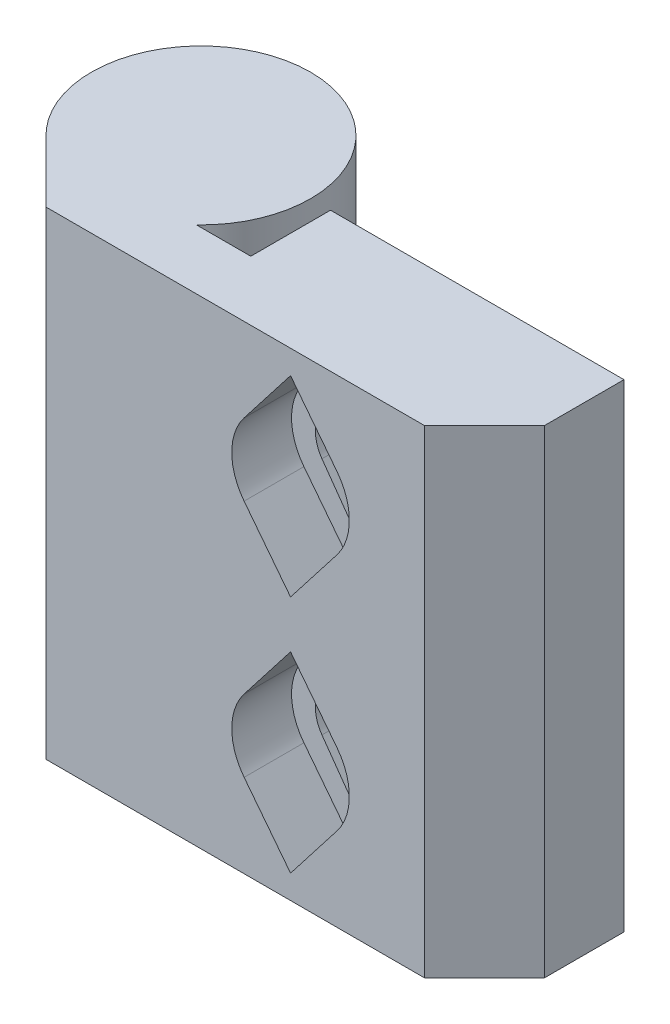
ISO-10303-21;
HEADER;
FILE_DESCRIPTION(('STEP AP214'),'2;1');
FILE_NAME('part.step','',(''),(''),'','','');
FILE_SCHEMA(('AUTOMOTIVE_DESIGN { 1 0 10303 214 1 1 1 1 }'));
ENDSEC;
DATA;
#1=APPLICATION_CONTEXT('core data for automotive mechanical design processes');
#2=APPLICATION_PROTOCOL_DEFINITION('international standard','automotive_design',2000,#1);
#3=PRODUCT_CONTEXT('',#1,'mechanical');
#4=PRODUCT('Part','Part','',(#3));
#5=PRODUCT_RELATED_PRODUCT_CATEGORY('part','',(#4));
#6=PRODUCT_DEFINITION_FORMATION('','',#4);
#7=PRODUCT_DEFINITION_CONTEXT('part definition',#1,'design');
#8=PRODUCT_DEFINITION('design','',#6,#7);
#9=PRODUCT_DEFINITION_SHAPE('','',#8);
#10=(LENGTH_UNIT() NAMED_UNIT(*) SI_UNIT(.MILLI.,.METRE.));
#11=(NAMED_UNIT(*) PLANE_ANGLE_UNIT() SI_UNIT($,.RADIAN.));
#12=(NAMED_UNIT(*) SI_UNIT($,.STERADIAN.) SOLID_ANGLE_UNIT());
#13=UNCERTAINTY_MEASURE_WITH_UNIT(LENGTH_MEASURE(1.E-05),#10,'distance_accuracy_value','');
#14=(GEOMETRIC_REPRESENTATION_CONTEXT(3) GLOBAL_UNCERTAINTY_ASSIGNED_CONTEXT((#13)) GLOBAL_UNIT_ASSIGNED_CONTEXT((#10,
#11,#12)) REPRESENTATION_CONTEXT('',''));
#15=CARTESIAN_POINT('',(0.,0.,0.));
#16=DIRECTION('',(0.,0.,1.));
#17=DIRECTION('',(1.,0.,0.));
#18=AXIS2_PLACEMENT_3D('',#15,#16,#17);
#19=CARTESIAN_POINT('',(11.4950827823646,6.,4.));
#20=DIRECTION('',(0.,0.,-1.));
#21=DIRECTION('',(-1.,0.,0.));
#22=AXIS2_PLACEMENT_3D('',#19,#20,#21);
#23=PLANE('',#22);
#24=DIRECTION('',(-0.613374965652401,-0.789791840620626,0.));
#25=VECTOR('',#24,1.);
#26=CARTESIAN_POINT('',(9.16519685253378,7.80945614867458,4.));
#27=LINE('',#26,#25);
#28=CARTESIAN_POINT('',(11.4950827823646,10.8094561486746,4.));
#29=VERTEX_POINT('',#28);
#30=CARTESIAN_POINT('',(9.16519685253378,7.80945614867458,4.));
#31=VERTEX_POINT('',#30);
#32=EDGE_CURVE('E395',#29,#31,#27,.T.);
#33=ORIENTED_EDGE('',*,*,#32,.T.);
#34=CARTESIAN_POINT('',(11.4950827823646,6.,4.));
#35=DIRECTION('',(0.,0.,1.));
#36=DIRECTION('',(-1.,0.,0.));
#37=AXIS2_PLACEMENT_3D('',#34,#35,#36);
#38=CIRCLE('',#37,2.95);
#39=CARTESIAN_POINT('',(9.16519685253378,4.19054385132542,4.));
#40=VERTEX_POINT('',#39);
#41=EDGE_CURVE('E398',#31,#40,#38,.T.);
#42=ORIENTED_EDGE('',*,*,#41,.T.);
#43=DIRECTION('',(0.613374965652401,-0.789791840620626,0.));
#44=VECTOR('',#43,1.);
#45=CARTESIAN_POINT('',(9.16519685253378,4.19054385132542,4.));
#46=LINE('',#45,#44);
#47=CARTESIAN_POINT('',(11.4950827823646,1.19054385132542,4.));
#48=VERTEX_POINT('',#47);
#49=EDGE_CURVE('E402',#40,#48,#46,.T.);
#50=ORIENTED_EDGE('',*,*,#49,.T.);
#51=DIRECTION('',(0.613374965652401,0.789791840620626,0.));
#52=VECTOR('',#51,1.);
#53=CARTESIAN_POINT('',(11.4950827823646,1.19054385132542,4.));
#54=LINE('',#53,#52);
#55=CARTESIAN_POINT('',(13.8249687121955,4.19054385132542,4.));
#56=VERTEX_POINT('',#55);
#57=EDGE_CURVE('E405',#48,#56,#54,.T.);
#58=ORIENTED_EDGE('',*,*,#57,.T.);
#59=CARTESIAN_POINT('',(11.4950827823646,6.,4.));
#60=DIRECTION('',(0.,0.,1.));
#61=DIRECTION('',(-1.,0.,0.));
#62=AXIS2_PLACEMENT_3D('',#59,#60,#61);
#63=CIRCLE('',#62,2.95);
#64=CARTESIAN_POINT('',(13.8249687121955,7.80945614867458,4.));
#65=VERTEX_POINT('',#64);
#66=EDGE_CURVE('E408',#56,#65,#63,.T.);
#67=ORIENTED_EDGE('',*,*,#66,.T.);
#68=DIRECTION('',(-0.6133749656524,0.789791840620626,0.));
#69=VECTOR('',#68,1.);
#70=CARTESIAN_POINT('',(11.4950827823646,10.8094561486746,4.));
#71=LINE('',#70,#69);
#72=EDGE_CURVE('E411',#65,#29,#71,.T.);
#73=ORIENTED_EDGE('',*,*,#72,.T.);
#74=EDGE_LOOP('',(#33,#42,#50,#58,#67,#73));
#75=FACE_BOUND('',#74,.T.);
#76=CARTESIAN_POINT('',(11.4950827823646,6.,4.));
#77=DIRECTION('',(0.,0.,1.));
#78=DIRECTION('',(-1.,0.,0.));
#79=AXIS2_PLACEMENT_3D('',#76,#77,#78);
#80=CIRCLE('',#79,1.75);
#81=CARTESIAN_POINT('',(10.0699059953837,7.01556443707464,4.));
#82=VERTEX_POINT('',#81);
#83=CARTESIAN_POINT('',(10.0699059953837,4.98443556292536,4.));
#84=VERTEX_POINT('',#83);
#85=EDGE_CURVE('E313',#82,#84,#80,.T.);
#86=ORIENTED_EDGE('',*,*,#85,.F.);
#87=DIRECTION('',(-0.580322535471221,-0.814386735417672,0.));
#88=VECTOR('',#87,1.);
#89=CARTESIAN_POINT('',(10.0699059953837,7.01556443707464,4.));
#90=LINE('',#89,#88);
#91=CARTESIAN_POINT('',(11.4950827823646,9.01556443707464,4.));
#92=VERTEX_POINT('',#91);
#93=EDGE_CURVE('E326',#92,#82,#90,.T.);
#94=ORIENTED_EDGE('',*,*,#93,.F.);
#95=DIRECTION('',(-0.580322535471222,0.814386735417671,0.));
#96=VECTOR('',#95,1.);
#97=CARTESIAN_POINT('',(11.4950827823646,9.01556443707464,4.));
#98=LINE('',#97,#96);
#99=CARTESIAN_POINT('',(12.9202595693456,7.01556443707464,4.));
#100=VERTEX_POINT('',#99);
#101=EDGE_CURVE('E50',#100,#92,#98,.T.);
#102=ORIENTED_EDGE('',*,*,#101,.F.);
#103=CARTESIAN_POINT('',(11.4950827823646,6.,4.));
#104=DIRECTION('',(0.,0.,1.));
#105=DIRECTION('',(-1.,0.,0.));
#106=AXIS2_PLACEMENT_3D('',#103,#104,#105);
#107=CIRCLE('',#106,1.75);
#108=CARTESIAN_POINT('',(12.9202595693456,4.98443556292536,4.));
#109=VERTEX_POINT('',#108);
#110=EDGE_CURVE('E322',#109,#100,#107,.T.);
#111=ORIENTED_EDGE('',*,*,#110,.F.);
#112=DIRECTION('',(0.580322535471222,0.814386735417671,0.));
#113=VECTOR('',#112,1.);
#114=CARTESIAN_POINT('',(11.4950827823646,2.98443556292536,4.));
#115=LINE('',#114,#113);
#116=CARTESIAN_POINT('',(11.4950827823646,2.98443556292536,4.));
#117=VERTEX_POINT('',#116);
#118=EDGE_CURVE('E319',#117,#109,#115,.T.);
#119=ORIENTED_EDGE('',*,*,#118,.F.);
#120=DIRECTION('',(0.580322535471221,-0.814386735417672,0.));
#121=VECTOR('',#120,1.);
#122=CARTESIAN_POINT('',(10.0699059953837,4.98443556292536,4.));
#123=LINE('',#122,#121);
#124=EDGE_CURVE('E316',#84,#117,#123,.T.);
#125=ORIENTED_EDGE('',*,*,#124,.F.);
#126=EDGE_LOOP('',(#86,#94,#102,#111,#119,#125));
#127=FACE_BOUND('',#126,.T.);
#128=ADVANCED_FACE('F35',(#75,#127),#23,.F.);
#129=CARTESIAN_POINT('',(-3.77491721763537,49.1793566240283,4.));
#130=DIRECTION('',(0.,0.,1.));
#131=DIRECTION('',(1.,0.,0.));
#132=AXIS2_PLACEMENT_3D('',#129,#130,#131);
#133=PLANE('',#132);
#134=DIRECTION('',(0.,1.,0.));
#135=VECTOR('',#134,1.);
#136=CARTESIAN_POINT('',(6.5,24.,4.));
#137=LINE('',#136,#135);
#138=CARTESIAN_POINT('',(6.5,0.,4.));
#139=VERTEX_POINT('',#138);
#140=CARTESIAN_POINT('',(6.5,24.,4.));
#141=VERTEX_POINT('',#140);
#142=EDGE_CURVE('E384',#139,#141,#137,.T.);
#143=ORIENTED_EDGE('',*,*,#142,.F.);
#144=DIRECTION('',(-1.,0.,0.));
#145=VECTOR('',#144,1.);
#146=CARTESIAN_POINT('',(-3.77491721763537,0.,4.));
#147=LINE('',#146,#145);
#148=CARTESIAN_POINT('',(3.77491721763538,0.,4.));
#149=VERTEX_POINT('',#148);
#150=EDGE_CURVE('E465',#139,#149,#147,.T.);
#151=ORIENTED_EDGE('',*,*,#150,.T.);
#152=DIRECTION('',(0.,-1.,0.));
#153=VECTOR('',#152,1.);
#154=CARTESIAN_POINT('',(3.77491721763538,12.,4.));
#155=LINE('',#154,#153);
#156=CARTESIAN_POINT('',(3.77491721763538,24.,4.));
#157=VERTEX_POINT('',#156);
#158=EDGE_CURVE('E482',#149,#157,#155,.F.);
#159=ORIENTED_EDGE('',*,*,#158,.T.);
#160=DIRECTION('',(-1.,0.,0.));
#161=VECTOR('',#160,1.);
#162=CARTESIAN_POINT('',(-3.77491721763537,24.,4.));
#163=LINE('',#162,#161);
#164=EDGE_CURVE('E467',#141,#157,#163,.T.);
#165=ORIENTED_EDGE('',*,*,#164,.F.);
#166=EDGE_LOOP('',(#143,#151,#159,#165));
#167=FACE_BOUND('',#166,.T.);
#168=ADVANCED_FACE('F523',(#167),#133,.F.);
#169=CARTESIAN_POINT('',(0.,12.,0.));
#170=DIRECTION('',(0.,-1.,0.));
#171=DIRECTION('',(0.,0.,-1.));
#172=AXIS2_PLACEMENT_3D('',#169,#170,#171);
#173=CYLINDRICAL_SURFACE('',#172,5.5);
#174=DIRECTION('',(0.,-1.,0.));
#175=VECTOR('',#174,1.);
#176=CARTESIAN_POINT('',(-3.77491721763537,49.1793566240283,4.));
#177=LINE('',#176,#175);
#178=CARTESIAN_POINT('',(-3.77491721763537,24.,4.));
#179=VERTEX_POINT('',#178);
#180=CARTESIAN_POINT('',(-3.77491721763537,0.,4.));
#181=VERTEX_POINT('',#180);
#182=EDGE_CURVE('E464',#179,#181,#177,.T.);
#183=ORIENTED_EDGE('',*,*,#182,.F.);
#184=CARTESIAN_POINT('',(0.,24.,0.));
#185=DIRECTION('',(0.,1.,0.));
#186=DIRECTION('',(0.,0.,1.));
#187=AXIS2_PLACEMENT_3D('',#184,#185,#186);
#188=CIRCLE('',#187,5.5);
#189=EDGE_CURVE('E497',#157,#179,#188,.T.);
#190=ORIENTED_EDGE('',*,*,#189,.F.);
#191=ORIENTED_EDGE('',*,*,#158,.F.);
#192=CARTESIAN_POINT('',(0.,0.,0.));
#193=DIRECTION('',(0.,1.,0.));
#194=DIRECTION('',(0.,0.,1.));
#195=AXIS2_PLACEMENT_3D('',#192,#193,#194);
#196=CIRCLE('',#195,5.5);
#197=EDGE_CURVE('E11',#149,#181,#196,.T.);
#198=ORIENTED_EDGE('',*,*,#197,.T.);
#199=EDGE_LOOP('',(#183,#190,#191,#198));
#200=FACE_BOUND('',#199,.T.);
#201=ADVANCED_FACE('F37',(#200),#173,.T.);
#202=CARTESIAN_POINT('',(0.,12.,0.));
#203=DIRECTION('',(0.,-1.,0.));
#204=DIRECTION('',(0.,0.,-1.));
#205=AXIS2_PLACEMENT_3D('',#202,#203,#204);
#206=CYLINDRICAL_SURFACE('',#205,5.);
#207=CARTESIAN_POINT('',(0.,0.,0.));
#208=DIRECTION('',(0.,1.,0.));
#209=DIRECTION('',(0.,0.,1.));
#210=AXIS2_PLACEMENT_3D('',#207,#208,#209);
#211=CIRCLE('',#210,5.);
#212=CARTESIAN_POINT('',(0.,0.,5.));
#213=VERTEX_POINT('',#212);
#214=EDGE_CURVE('E43',#213,#213,#211,.T.);
#215=ORIENTED_EDGE('',*,*,#214,.F.);
#216=EDGE_LOOP('',(#215));
#217=FACE_BOUND('',#216,.T.);
#218=CARTESIAN_POINT('',(0.,12.,0.));
#219=DIRECTION('',(0.,1.,0.));
#220=DIRECTION('',(0.,0.,1.));
#221=AXIS2_PLACEMENT_3D('',#218,#219,#220);
#222=CIRCLE('',#221,5.);
#223=CARTESIAN_POINT('',(0.,12.,5.));
#224=VERTEX_POINT('',#223);
#225=EDGE_CURVE('E500',#224,#224,#222,.T.);
#226=ORIENTED_EDGE('',*,*,#225,.T.);
#227=EDGE_LOOP('',(#226));
#228=FACE_BOUND('',#227,.T.);
#229=ADVANCED_FACE('F508',(#217,#228),#206,.F.);
#230=CARTESIAN_POINT('',(0.,12.,0.));
#231=DIRECTION('',(0.,1.,0.));
#232=DIRECTION('',(0.,0.,1.));
#233=AXIS2_PLACEMENT_3D('',#230,#231,#232);
#234=PLANE('',#233);
#235=ORIENTED_EDGE('',*,*,#225,.F.);
#236=EDGE_LOOP('',(#235));
#237=FACE_BOUND('',#236,.T.);
#238=ADVANCED_FACE('F511',(#237),#234,.F.);
#239=CARTESIAN_POINT('',(0.,0.,0.));
#240=DIRECTION('',(0.,1.,0.));
#241=DIRECTION('',(0.,0.,1.));
#242=AXIS2_PLACEMENT_3D('',#239,#240,#241);
#243=PLANE('',#242);
#244=ORIENTED_EDGE('',*,*,#214,.T.);
#245=EDGE_LOOP('',(#244));
#246=FACE_BOUND('',#245,.T.);
#247=DIRECTION('',(0.707106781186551,0.,0.707106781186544));
#248=VECTOR('',#247,1.);
#249=CARTESIAN_POINT('',(-0.77491721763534,0.,7.));
#250=LINE('',#249,#248);
#251=CARTESIAN_POINT('',(-0.77491721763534,0.,7.));
#252=VERTEX_POINT('',#251);
#253=EDGE_CURVE('E476',#181,#252,#250,.T.);
#254=ORIENTED_EDGE('',*,*,#253,.F.);
#255=ORIENTED_EDGE('',*,*,#197,.F.);
#256=ORIENTED_EDGE('',*,*,#150,.F.);
#257=DIRECTION('',(0.,0.,1.));
#258=VECTOR('',#257,1.);
#259=CARTESIAN_POINT('',(6.5,0.,0.));
#260=LINE('',#259,#258);
#261=CARTESIAN_POINT('',(6.5,0.,0.));
#262=VERTEX_POINT('',#261);
#263=EDGE_CURVE('E458',#262,#139,#260,.T.);
#264=ORIENTED_EDGE('',*,*,#263,.F.);
#265=DIRECTION('',(-1.,0.,0.));
#266=VECTOR('',#265,1.);
#267=CARTESIAN_POINT('',(21.2250827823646,0.,0.));
#268=LINE('',#267,#266);
#269=CARTESIAN_POINT('',(21.2250827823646,0.,0.));
#270=VERTEX_POINT('',#269);
#271=EDGE_CURVE('E444',#270,#262,#268,.T.);
#272=ORIENTED_EDGE('',*,*,#271,.F.);
#273=DIRECTION('',(0.,0.,1.));
#274=VECTOR('',#273,1.);
#275=CARTESIAN_POINT('',(21.2250827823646,0.,0.));
#276=LINE('',#275,#274);
#277=CARTESIAN_POINT('',(21.2250827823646,0.,4.));
#278=VERTEX_POINT('',#277);
#279=EDGE_CURVE('E461',#270,#278,#276,.T.);
#280=ORIENTED_EDGE('',*,*,#279,.T.);
#281=DIRECTION('',(0.707106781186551,0.,-0.707106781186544));
#282=VECTOR('',#281,1.);
#283=CARTESIAN_POINT('',(21.2250827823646,0.,4.));
#284=LINE('',#283,#282);
#285=CARTESIAN_POINT('',(18.2250827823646,0.,7.));
#286=VERTEX_POINT('',#285);
#287=EDGE_CURVE('E469',#286,#278,#284,.T.);
#288=ORIENTED_EDGE('',*,*,#287,.F.);
#289=DIRECTION('',(1.,0.,0.));
#290=VECTOR('',#289,1.);
#291=CARTESIAN_POINT('',(18.2250827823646,0.,7.));
#292=LINE('',#291,#290);
#293=EDGE_CURVE('E472',#252,#286,#292,.T.);
#294=ORIENTED_EDGE('',*,*,#293,.F.);
#295=EDGE_LOOP('',(#254,#255,#256,#264,#272,#280,#288,#294));
#296=FACE_BOUND('',#295,.T.);
#297=ADVANCED_FACE('F505',(#246,#296),#243,.F.);
#298=CARTESIAN_POINT('',(0.,24.,0.));
#299=DIRECTION('',(0.,1.,0.));
#300=DIRECTION('',(0.,0.,1.));
#301=AXIS2_PLACEMENT_3D('',#298,#299,#300);
#302=PLANE('',#301);
#303=ORIENTED_EDGE('',*,*,#189,.T.);
#304=DIRECTION('',(0.707106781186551,0.,0.707106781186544));
#305=VECTOR('',#304,1.);
#306=CARTESIAN_POINT('',(-0.77491721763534,24.,7.));
#307=LINE('',#306,#305);
#308=CARTESIAN_POINT('',(-0.77491721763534,24.,7.));
#309=VERTEX_POINT('',#308);
#310=EDGE_CURVE('E486',#179,#309,#307,.T.);
#311=ORIENTED_EDGE('',*,*,#310,.T.);
#312=DIRECTION('',(1.,0.,0.));
#313=VECTOR('',#312,1.);
#314=CARTESIAN_POINT('',(18.2250827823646,24.,7.));
#315=LINE('',#314,#313);
#316=CARTESIAN_POINT('',(18.2250827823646,24.,7.));
#317=VERTEX_POINT('',#316);
#318=EDGE_CURVE('E483',#309,#317,#315,.T.);
#319=ORIENTED_EDGE('',*,*,#318,.T.);
#320=DIRECTION('',(0.707106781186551,0.,-0.707106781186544));
#321=VECTOR('',#320,1.);
#322=CARTESIAN_POINT('',(21.2250827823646,24.,4.));
#323=LINE('',#322,#321);
#324=CARTESIAN_POINT('',(21.2250827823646,24.,4.));
#325=VERTEX_POINT('',#324);
#326=EDGE_CURVE('E479',#317,#325,#323,.T.);
#327=ORIENTED_EDGE('',*,*,#326,.T.);
#328=DIRECTION('',(0.,0.,1.));
#329=VECTOR('',#328,1.);
#330=CARTESIAN_POINT('',(21.2250827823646,24.,0.));
#331=LINE('',#330,#329);
#332=CARTESIAN_POINT('',(21.2250827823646,24.,0.));
#333=VERTEX_POINT('',#332);
#334=EDGE_CURVE('E450',#333,#325,#331,.T.);
#335=ORIENTED_EDGE('',*,*,#334,.F.);
#336=DIRECTION('',(1.,0.,0.));
#337=VECTOR('',#336,1.);
#338=CARTESIAN_POINT('',(21.2250827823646,24.,0.));
#339=LINE('',#338,#337);
#340=CARTESIAN_POINT('',(6.5,24.,0.));
#341=VERTEX_POINT('',#340);
#342=EDGE_CURVE('E448',#341,#333,#339,.T.);
#343=ORIENTED_EDGE('',*,*,#342,.F.);
#344=DIRECTION('',(0.,0.,1.));
#345=VECTOR('',#344,1.);
#346=CARTESIAN_POINT('',(6.5,24.,0.));
#347=LINE('',#346,#345);
#348=EDGE_CURVE('E455',#341,#141,#347,.T.);
#349=ORIENTED_EDGE('',*,*,#348,.T.);
#350=ORIENTED_EDGE('',*,*,#164,.T.);
#351=EDGE_LOOP('',(#303,#311,#319,#327,#335,#343,#349,#350));
#352=FACE_BOUND('',#351,.T.);
#353=ADVANCED_FACE('F520',(#352),#302,.T.);
#354=CARTESIAN_POINT('',(-0.77491721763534,49.1793566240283,7.));
#355=DIRECTION('',(0.707106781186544,0.,-0.707106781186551));
#356=DIRECTION('',(-0.707106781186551,0.,-0.707106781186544));
#357=AXIS2_PLACEMENT_3D('',#354,#355,#356);
#358=PLANE('',#357);
#359=ORIENTED_EDGE('',*,*,#310,.F.);
#360=ORIENTED_EDGE('',*,*,#182,.T.);
#361=ORIENTED_EDGE('',*,*,#253,.T.);
#362=DIRECTION('',(0.,-1.,0.));
#363=VECTOR('',#362,1.);
#364=CARTESIAN_POINT('',(-0.77491721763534,49.1793566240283,7.));
#365=LINE('',#364,#363);
#366=EDGE_CURVE('E475',#309,#252,#365,.T.);
#367=ORIENTED_EDGE('',*,*,#366,.F.);
#368=EDGE_LOOP('',(#359,#360,#361,#367));
#369=FACE_BOUND('',#368,.T.);
#370=ADVANCED_FACE('F577',(#369),#358,.F.);
#371=CARTESIAN_POINT('',(18.2250827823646,49.1793566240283,7.));
#372=DIRECTION('',(0.,0.,-1.));
#373=DIRECTION('',(-1.,0.,0.));
#374=AXIS2_PLACEMENT_3D('',#371,#372,#373);
#375=PLANE('',#374);
#376=DIRECTION('',(0.613374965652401,-0.789791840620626,0.));
#377=VECTOR('',#376,1.);
#378=CARTESIAN_POINT('',(9.16519685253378,16.1905438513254,7.));
#379=LINE('',#378,#377);
#380=CARTESIAN_POINT('',(9.16519685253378,16.1905438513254,7.));
#381=VERTEX_POINT('',#380);
#382=CARTESIAN_POINT('',(11.4950827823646,13.1905438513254,7.));
#383=VERTEX_POINT('',#382);
#384=EDGE_CURVE('E367',#381,#383,#379,.T.);
#385=ORIENTED_EDGE('',*,*,#384,.F.);
#386=CARTESIAN_POINT('',(11.4950827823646,18.,7.));
#387=DIRECTION('',(0.,0.,1.));
#388=DIRECTION('',(1.,0.,0.));
#389=AXIS2_PLACEMENT_3D('',#386,#387,#388);
#390=CIRCLE('',#389,2.95);
#391=CARTESIAN_POINT('',(9.16519685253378,19.8094561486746,7.));
#392=VERTEX_POINT('',#391);
#393=EDGE_CURVE('E365',#392,#381,#390,.T.);
#394=ORIENTED_EDGE('',*,*,#393,.F.);
#395=DIRECTION('',(-0.613374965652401,-0.789791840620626,0.));
#396=VECTOR('',#395,1.);
#397=CARTESIAN_POINT('',(9.16519685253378,19.8094561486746,7.));
#398=LINE('',#397,#396);
#399=CARTESIAN_POINT('',(11.4950827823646,22.8094561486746,7.));
#400=VERTEX_POINT('',#399);
#401=EDGE_CURVE('E349',#400,#392,#398,.T.);
#402=ORIENTED_EDGE('',*,*,#401,.F.);
#403=DIRECTION('',(-0.613374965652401,0.789791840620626,0.));
#404=VECTOR('',#403,1.);
#405=CARTESIAN_POINT('',(11.4950827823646,22.8094561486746,7.));
#406=LINE('',#405,#404);
#407=CARTESIAN_POINT('',(13.8249687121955,19.8094561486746,7.));
#408=VERTEX_POINT('',#407);
#409=EDGE_CURVE('E377',#408,#400,#406,.T.);
#410=ORIENTED_EDGE('',*,*,#409,.F.);
#411=CARTESIAN_POINT('',(11.4950827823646,18.,7.));
#412=DIRECTION('',(0.,0.,1.));
#413=DIRECTION('',(1.,0.,0.));
#414=AXIS2_PLACEMENT_3D('',#411,#412,#413);
#415=CIRCLE('',#414,2.95);
#416=CARTESIAN_POINT('',(13.8249687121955,16.1905438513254,7.));
#417=VERTEX_POINT('',#416);
#418=EDGE_CURVE('E374',#417,#408,#415,.T.);
#419=ORIENTED_EDGE('',*,*,#418,.F.);
#420=DIRECTION('',(0.6133749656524,0.789791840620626,0.));
#421=VECTOR('',#420,1.);
#422=CARTESIAN_POINT('',(11.4950827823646,13.1905438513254,7.));
#423=LINE('',#422,#421);
#424=EDGE_CURVE('E371',#383,#417,#423,.T.);
#425=ORIENTED_EDGE('',*,*,#424,.F.);
#426=EDGE_LOOP('',(#385,#394,#402,#410,#419,#425));
#427=FACE_BOUND('',#426,.T.);
#428=CARTESIAN_POINT('',(11.4950827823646,6.,7.));
#429=DIRECTION('',(0.,0.,1.));
#430=DIRECTION('',(-1.,0.,0.));
#431=AXIS2_PLACEMENT_3D('',#428,#429,#430);
#432=CIRCLE('',#431,2.95);
#433=CARTESIAN_POINT('',(9.16519685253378,7.80945614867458,7.));
#434=VERTEX_POINT('',#433);
#435=CARTESIAN_POINT('',(9.16519685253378,4.19054385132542,7.));
#436=VERTEX_POINT('',#435);
#437=EDGE_CURVE('E416',#434,#436,#432,.T.);
#438=ORIENTED_EDGE('',*,*,#437,.F.);
#439=DIRECTION('',(-0.613374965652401,-0.789791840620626,0.));
#440=VECTOR('',#439,1.);
#441=CARTESIAN_POINT('',(9.16519685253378,7.80945614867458,7.));
#442=LINE('',#441,#440);
#443=CARTESIAN_POINT('',(11.4950827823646,10.8094561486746,7.));
#444=VERTEX_POINT('',#443);
#445=EDGE_CURVE('E256',#444,#434,#442,.T.);
#446=ORIENTED_EDGE('',*,*,#445,.F.);
#447=DIRECTION('',(-0.6133749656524,0.789791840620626,0.));
#448=VECTOR('',#447,1.);
#449=CARTESIAN_POINT('',(11.4950827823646,10.8094561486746,7.));
#450=LINE('',#449,#448);
#451=CARTESIAN_POINT('',(13.8249687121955,7.80945614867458,7.));
#452=VERTEX_POINT('',#451);
#453=EDGE_CURVE('E399',#452,#444,#450,.T.);
#454=ORIENTED_EDGE('',*,*,#453,.F.);
#455=CARTESIAN_POINT('',(11.4950827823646,6.,7.));
#456=DIRECTION('',(0.,0.,1.));
#457=DIRECTION('',(-1.,0.,0.));
#458=AXIS2_PLACEMENT_3D('',#455,#456,#457);
#459=CIRCLE('',#458,2.95);
#460=CARTESIAN_POINT('',(13.8249687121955,4.19054385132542,7.));
#461=VERTEX_POINT('',#460);
#462=EDGE_CURVE('E425',#461,#452,#459,.T.);
#463=ORIENTED_EDGE('',*,*,#462,.F.);
#464=DIRECTION('',(0.613374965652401,0.789791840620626,0.));
#465=VECTOR('',#464,1.);
#466=CARTESIAN_POINT('',(11.4950827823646,1.19054385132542,7.));
#467=LINE('',#466,#465);
#468=CARTESIAN_POINT('',(11.4950827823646,1.19054385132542,7.));
#469=VERTEX_POINT('',#468);
#470=EDGE_CURVE('E422',#469,#461,#467,.T.);
#471=ORIENTED_EDGE('',*,*,#470,.F.);
#472=DIRECTION('',(0.613374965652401,-0.789791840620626,0.));
#473=VECTOR('',#472,1.);
#474=CARTESIAN_POINT('',(9.16519685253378,4.19054385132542,7.));
#475=LINE('',#474,#473);
#476=EDGE_CURVE('E419',#436,#469,#475,.T.);
#477=ORIENTED_EDGE('',*,*,#476,.F.);
#478=EDGE_LOOP('',(#438,#446,#454,#463,#471,#477));
#479=FACE_BOUND('',#478,.T.);
#480=ORIENTED_EDGE('',*,*,#318,.F.);
#481=ORIENTED_EDGE('',*,*,#366,.T.);
#482=ORIENTED_EDGE('',*,*,#293,.T.);
#483=DIRECTION('',(0.,-1.,0.));
#484=VECTOR('',#483,1.);
#485=CARTESIAN_POINT('',(18.2250827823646,49.1793566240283,7.));
#486=LINE('',#485,#484);
#487=EDGE_CURVE('E471',#317,#286,#486,.T.);
#488=ORIENTED_EDGE('',*,*,#487,.F.);
#489=EDGE_LOOP('',(#480,#481,#482,#488));
#490=FACE_BOUND('',#489,.T.);
#491=ADVANCED_FACE('F573',(#427,#479,#490),#375,.F.);
#492=CARTESIAN_POINT('',(21.2250827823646,49.1793566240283,4.));
#493=DIRECTION('',(-0.707106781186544,0.,-0.707106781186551));
#494=DIRECTION('',(-0.707106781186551,0.,0.707106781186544));
#495=AXIS2_PLACEMENT_3D('',#492,#493,#494);
#496=PLANE('',#495);
#497=ORIENTED_EDGE('',*,*,#326,.F.);
#498=ORIENTED_EDGE('',*,*,#487,.T.);
#499=ORIENTED_EDGE('',*,*,#287,.T.);
#500=DIRECTION('',(0.,-1.,0.));
#501=VECTOR('',#500,1.);
#502=CARTESIAN_POINT('',(21.2250827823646,49.1793566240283,4.));
#503=LINE('',#502,#501);
#504=EDGE_CURVE('E468',#325,#278,#503,.T.);
#505=ORIENTED_EDGE('',*,*,#504,.F.);
#506=EDGE_LOOP('',(#497,#498,#499,#505));
#507=FACE_BOUND('',#506,.T.);
#508=ADVANCED_FACE('F568',(#507),#496,.F.);
#509=CARTESIAN_POINT('',(21.2250827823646,24.,0.));
#510=DIRECTION('',(-1.,0.,0.));
#511=DIRECTION('',(0.,0.,1.));
#512=AXIS2_PLACEMENT_3D('',#509,#510,#511);
#513=PLANE('',#512);
#514=ORIENTED_EDGE('',*,*,#504,.T.);
#515=ORIENTED_EDGE('',*,*,#279,.F.);
#516=DIRECTION('',(0.,-1.,0.));
#517=VECTOR('',#516,1.);
#518=CARTESIAN_POINT('',(21.2250827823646,24.,0.));
#519=LINE('',#518,#517);
#520=EDGE_CURVE('E441',#333,#270,#519,.T.);
#521=ORIENTED_EDGE('',*,*,#520,.F.);
#522=ORIENTED_EDGE('',*,*,#334,.T.);
#523=EDGE_LOOP('',(#514,#515,#521,#522));
#524=FACE_BOUND('',#523,.T.);
#525=ADVANCED_FACE('F565',(#524),#513,.F.);
#526=CARTESIAN_POINT('',(6.5,24.,0.));
#527=DIRECTION('',(1.,0.,0.));
#528=DIRECTION('',(0.,1.,0.));
#529=AXIS2_PLACEMENT_3D('',#526,#527,#528);
#530=PLANE('',#529);
#531=ORIENTED_EDGE('',*,*,#142,.T.);
#532=ORIENTED_EDGE('',*,*,#348,.F.);
#533=DIRECTION('',(0.,1.,0.));
#534=VECTOR('',#533,1.);
#535=CARTESIAN_POINT('',(6.5,24.,0.));
#536=LINE('',#535,#534);
#537=EDGE_CURVE('E446',#262,#341,#536,.T.);
#538=ORIENTED_EDGE('',*,*,#537,.F.);
#539=ORIENTED_EDGE('',*,*,#263,.T.);
#540=EDGE_LOOP('',(#531,#532,#538,#539));
#541=FACE_BOUND('',#540,.T.);
#542=ADVANCED_FACE('F562',(#541),#530,.F.);
#543=CARTESIAN_POINT('',(0.,0.,0.));
#544=DIRECTION('',(0.,0.,-1.));
#545=DIRECTION('',(-1.,0.,0.));
#546=AXIS2_PLACEMENT_3D('',#543,#544,#545);
#547=PLANE('',#546);
#548=DIRECTION('',(0.580322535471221,-0.814386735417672,0.));
#549=VECTOR('',#548,1.);
#550=CARTESIAN_POINT('',(10.0699059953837,16.9844355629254,0.));
#551=LINE('',#550,#549);
#552=CARTESIAN_POINT('',(10.0699059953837,16.9844355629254,0.));
#553=VERTEX_POINT('',#552);
#554=CARTESIAN_POINT('',(11.4950827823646,14.9844355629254,0.));
#555=VERTEX_POINT('',#554);
#556=EDGE_CURVE('E261',#553,#555,#551,.T.);
#557=ORIENTED_EDGE('',*,*,#556,.T.);
#558=DIRECTION('',(0.580322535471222,0.814386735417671,0.));
#559=VECTOR('',#558,1.);
#560=CARTESIAN_POINT('',(11.4950827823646,14.9844355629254,0.));
#561=LINE('',#560,#559);
#562=CARTESIAN_POINT('',(12.9202595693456,16.9844355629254,0.));
#563=VERTEX_POINT('',#562);
#564=EDGE_CURVE('E245',#555,#563,#561,.T.);
#565=ORIENTED_EDGE('',*,*,#564,.T.);
#566=CARTESIAN_POINT('',(11.4950827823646,18.,0.));
#567=DIRECTION('',(0.,0.,-1.));
#568=DIRECTION('',(-1.,0.,0.));
#569=AXIS2_PLACEMENT_3D('',#566,#567,#568);
#570=CIRCLE('',#569,1.75);
#571=CARTESIAN_POINT('',(12.9202595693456,19.0155644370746,0.));
#572=VERTEX_POINT('',#571);
#573=EDGE_CURVE('E344',#563,#572,#570,.F.);
#574=ORIENTED_EDGE('',*,*,#573,.T.);
#575=DIRECTION('',(-0.580322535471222,0.814386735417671,0.));
#576=VECTOR('',#575,1.);
#577=CARTESIAN_POINT('',(11.4950827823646,21.0155644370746,0.));
#578=LINE('',#577,#576);
#579=CARTESIAN_POINT('',(11.4950827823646,21.0155644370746,0.));
#580=VERTEX_POINT('',#579);
#581=EDGE_CURVE('E901',#572,#580,#578,.T.);
#582=ORIENTED_EDGE('',*,*,#581,.T.);
#583=DIRECTION('',(-0.580322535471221,-0.814386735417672,0.));
#584=VECTOR('',#583,1.);
#585=CARTESIAN_POINT('',(10.0699059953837,19.0155644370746,0.));
#586=LINE('',#585,#584);
#587=CARTESIAN_POINT('',(10.0699059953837,19.0155644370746,0.));
#588=VERTEX_POINT('',#587);
#589=EDGE_CURVE('E276',#580,#588,#586,.T.);
#590=ORIENTED_EDGE('',*,*,#589,.T.);
#591=CARTESIAN_POINT('',(11.4950827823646,18.,0.));
#592=DIRECTION('',(0.,0.,-1.));
#593=DIRECTION('',(-1.,0.,0.));
#594=AXIS2_PLACEMENT_3D('',#591,#592,#593);
#595=CIRCLE('',#594,1.75);
#596=EDGE_CURVE('E272',#588,#553,#595,.F.);
#597=ORIENTED_EDGE('',*,*,#596,.T.);
#598=EDGE_LOOP('',(#557,#565,#574,#582,#590,#597));
#599=FACE_BOUND('',#598,.T.);
#600=CARTESIAN_POINT('',(11.4950827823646,6.,0.));
#601=DIRECTION('',(0.,0.,-1.));
#602=DIRECTION('',(-1.,0.,0.));
#603=AXIS2_PLACEMENT_3D('',#600,#601,#602);
#604=CIRCLE('',#603,1.75);
#605=CARTESIAN_POINT('',(10.0699059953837,7.01556443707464,0.));
#606=VERTEX_POINT('',#605);
#607=CARTESIAN_POINT('',(10.0699059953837,4.98443556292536,0.));
#608=VERTEX_POINT('',#607);
#609=EDGE_CURVE('E310',#606,#608,#604,.F.);
#610=ORIENTED_EDGE('',*,*,#609,.T.);
#611=DIRECTION('',(0.580322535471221,-0.814386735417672,0.));
#612=VECTOR('',#611,1.);
#613=CARTESIAN_POINT('',(10.0699059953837,4.98443556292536,0.));
#614=LINE('',#613,#612);
#615=CARTESIAN_POINT('',(11.4950827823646,2.98443556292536,0.));
#616=VERTEX_POINT('',#615);
#617=EDGE_CURVE('E332',#608,#616,#614,.T.);
#618=ORIENTED_EDGE('',*,*,#617,.T.);
#619=DIRECTION('',(0.580322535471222,0.814386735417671,0.));
#620=VECTOR('',#619,1.);
#621=CARTESIAN_POINT('',(11.4950827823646,2.98443556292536,0.));
#622=LINE('',#621,#620);
#623=CARTESIAN_POINT('',(12.9202595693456,4.98443556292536,0.));
#624=VERTEX_POINT('',#623);
#625=EDGE_CURVE('E298',#616,#624,#622,.T.);
#626=ORIENTED_EDGE('',*,*,#625,.T.);
#627=CARTESIAN_POINT('',(11.4950827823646,6.,0.));
#628=DIRECTION('',(0.,0.,-1.));
#629=DIRECTION('',(-1.,0.,0.));
#630=AXIS2_PLACEMENT_3D('',#627,#628,#629);
#631=CIRCLE('',#630,1.75);
#632=CARTESIAN_POINT('',(12.9202595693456,7.01556443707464,0.));
#633=VERTEX_POINT('',#632);
#634=EDGE_CURVE('E301',#624,#633,#631,.F.);
#635=ORIENTED_EDGE('',*,*,#634,.T.);
#636=DIRECTION('',(-0.580322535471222,0.814386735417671,0.));
#637=VECTOR('',#636,1.);
#638=CARTESIAN_POINT('',(11.4950827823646,9.01556443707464,0.));
#639=LINE('',#638,#637);
#640=CARTESIAN_POINT('',(11.4950827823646,9.01556443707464,0.));
#641=VERTEX_POINT('',#640);
#642=EDGE_CURVE('E304',#633,#641,#639,.T.);
#643=ORIENTED_EDGE('',*,*,#642,.T.);
#644=DIRECTION('',(-0.580322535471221,-0.814386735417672,0.));
#645=VECTOR('',#644,1.);
#646=CARTESIAN_POINT('',(10.0699059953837,7.01556443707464,0.));
#647=LINE('',#646,#645);
#648=EDGE_CURVE('E307',#641,#606,#647,.T.);
#649=ORIENTED_EDGE('',*,*,#648,.T.);
#650=EDGE_LOOP('',(#610,#618,#626,#635,#643,#649));
#651=FACE_BOUND('',#650,.T.);
#652=ORIENTED_EDGE('',*,*,#520,.T.);
#653=ORIENTED_EDGE('',*,*,#271,.T.);
#654=ORIENTED_EDGE('',*,*,#537,.T.);
#655=ORIENTED_EDGE('',*,*,#342,.T.);
#656=EDGE_LOOP('',(#652,#653,#654,#655));
#657=FACE_BOUND('',#656,.T.);
#658=ADVANCED_FACE('F269',(#599,#651,#657),#547,.T.);
#659=CARTESIAN_POINT('',(9.16519685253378,7.80945614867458,4.));
#660=DIRECTION('',(-0.789791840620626,0.613374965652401,0.));
#661=DIRECTION('',(-0.613374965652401,-0.789791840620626,0.));
#662=AXIS2_PLACEMENT_3D('',#659,#660,#661);
#663=PLANE('',#662);
#664=ORIENTED_EDGE('',*,*,#445,.T.);
#665=DIRECTION('',(0.,0.,1.));
#666=VECTOR('',#665,1.);
#667=CARTESIAN_POINT('',(9.16519685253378,7.80945614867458,4.));
#668=LINE('',#667,#666);
#669=EDGE_CURVE('E414',#31,#434,#668,.T.);
#670=ORIENTED_EDGE('',*,*,#669,.F.);
#671=ORIENTED_EDGE('',*,*,#32,.F.);
#672=DIRECTION('',(0.,0.,1.));
#673=VECTOR('',#672,1.);
#674=CARTESIAN_POINT('',(11.4950827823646,10.8094561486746,4.));
#675=LINE('',#674,#673);
#676=EDGE_CURVE('E368',#29,#444,#675,.T.);
#677=ORIENTED_EDGE('',*,*,#676,.T.);
#678=EDGE_LOOP('',(#664,#670,#671,#677));
#679=FACE_BOUND('',#678,.T.);
#680=ADVANCED_FACE('F540',(#679),#663,.F.);
#681=CARTESIAN_POINT('',(11.4950827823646,10.8094561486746,4.));
#682=DIRECTION('',(0.789791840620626,0.6133749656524,0.));
#683=DIRECTION('',(-0.6133749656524,0.789791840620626,0.));
#684=AXIS2_PLACEMENT_3D('',#681,#682,#683);
#685=PLANE('',#684);
#686=ORIENTED_EDGE('',*,*,#453,.T.);
#687=ORIENTED_EDGE('',*,*,#676,.F.);
#688=ORIENTED_EDGE('',*,*,#72,.F.);
#689=DIRECTION('',(0.,0.,1.));
#690=VECTOR('',#689,1.);
#691=CARTESIAN_POINT('',(13.8249687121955,7.80945614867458,4.));
#692=LINE('',#691,#690);
#693=EDGE_CURVE('E431',#65,#452,#692,.T.);
#694=ORIENTED_EDGE('',*,*,#693,.T.);
#695=EDGE_LOOP('',(#686,#687,#688,#694));
#696=FACE_BOUND('',#695,.T.);
#697=ADVANCED_FACE('F536',(#696),#685,.F.);
#698=CARTESIAN_POINT('',(11.4950827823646,6.,4.));
#699=DIRECTION('',(0.,0.,1.));
#700=DIRECTION('',(1.,0.,0.));
#701=AXIS2_PLACEMENT_3D('',#698,#699,#700);
#702=CYLINDRICAL_SURFACE('',#701,2.95);
#703=ORIENTED_EDGE('',*,*,#462,.T.);
#704=ORIENTED_EDGE('',*,*,#693,.F.);
#705=ORIENTED_EDGE('',*,*,#66,.F.);
#706=DIRECTION('',(0.,0.,1.));
#707=VECTOR('',#706,1.);
#708=CARTESIAN_POINT('',(13.8249687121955,4.19054385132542,4.));
#709=LINE('',#708,#707);
#710=EDGE_CURVE('E433',#56,#461,#709,.T.);
#711=ORIENTED_EDGE('',*,*,#710,.T.);
#712=EDGE_LOOP('',(#703,#704,#705,#711));
#713=FACE_BOUND('',#712,.T.);
#714=ADVANCED_FACE('F539',(#713),#702,.F.);
#715=CARTESIAN_POINT('',(11.4950827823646,1.19054385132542,4.));
#716=DIRECTION('',(0.789791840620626,-0.6133749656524,0.));
#717=DIRECTION('',(0.613374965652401,0.789791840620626,0.));
#718=AXIS2_PLACEMENT_3D('',#715,#716,#717);
#719=PLANE('',#718);
#720=ORIENTED_EDGE('',*,*,#470,.T.);
#721=ORIENTED_EDGE('',*,*,#710,.F.);
#722=ORIENTED_EDGE('',*,*,#57,.F.);
#723=DIRECTION('',(0.,0.,1.));
#724=VECTOR('',#723,1.);
#725=CARTESIAN_POINT('',(11.4950827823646,1.19054385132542,4.));
#726=LINE('',#725,#724);
#727=EDGE_CURVE('E435',#48,#469,#726,.T.);
#728=ORIENTED_EDGE('',*,*,#727,.T.);
#729=EDGE_LOOP('',(#720,#721,#722,#728));
#730=FACE_BOUND('',#729,.T.);
#731=ADVANCED_FACE('F544',(#730),#719,.F.);
#732=CARTESIAN_POINT('',(9.16519685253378,4.19054385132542,4.));
#733=DIRECTION('',(-0.789791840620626,-0.613374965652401,0.));
#734=DIRECTION('',(0.613374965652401,-0.789791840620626,0.));
#735=AXIS2_PLACEMENT_3D('',#732,#733,#734);
#736=PLANE('',#735);
#737=ORIENTED_EDGE('',*,*,#476,.T.);
#738=ORIENTED_EDGE('',*,*,#727,.F.);
#739=ORIENTED_EDGE('',*,*,#49,.F.);
#740=DIRECTION('',(0.,0.,1.));
#741=VECTOR('',#740,1.);
#742=CARTESIAN_POINT('',(9.16519685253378,4.19054385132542,4.));
#743=LINE('',#742,#741);
#744=EDGE_CURVE('E437',#40,#436,#743,.T.);
#745=ORIENTED_EDGE('',*,*,#744,.T.);
#746=EDGE_LOOP('',(#737,#738,#739,#745));
#747=FACE_BOUND('',#746,.T.);
#748=ADVANCED_FACE('F548',(#747),#736,.F.);
#749=CARTESIAN_POINT('',(11.4950827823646,6.,4.));
#750=DIRECTION('',(0.,0.,1.));
#751=DIRECTION('',(1.,0.,0.));
#752=AXIS2_PLACEMENT_3D('',#749,#750,#751);
#753=CYLINDRICAL_SURFACE('',#752,2.95);
#754=ORIENTED_EDGE('',*,*,#437,.T.);
#755=ORIENTED_EDGE('',*,*,#744,.F.);
#756=ORIENTED_EDGE('',*,*,#41,.F.);
#757=ORIENTED_EDGE('',*,*,#669,.T.);
#758=EDGE_LOOP('',(#754,#755,#756,#757));
#759=FACE_BOUND('',#758,.T.);
#760=ADVANCED_FACE('F552',(#759),#753,.F.);
#761=CARTESIAN_POINT('',(11.4950827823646,18.,4.));
#762=DIRECTION('',(0.,0.,1.));
#763=DIRECTION('',(1.,0.,0.));
#764=AXIS2_PLACEMENT_3D('',#761,#762,#763);
#765=CYLINDRICAL_SURFACE('',#764,2.95);
#766=ORIENTED_EDGE('',*,*,#393,.T.);
#767=DIRECTION('',(0.,0.,1.));
#768=VECTOR('',#767,1.);
#769=CARTESIAN_POINT('',(9.16519685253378,16.1905438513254,4.));
#770=LINE('',#769,#768);
#771=CARTESIAN_POINT('',(9.16519685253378,16.1905438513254,4.));
#772=VERTEX_POINT('',#771);
#773=EDGE_CURVE('E364',#772,#381,#770,.T.);
#774=ORIENTED_EDGE('',*,*,#773,.F.);
#775=CARTESIAN_POINT('',(11.4950827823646,18.,4.));
#776=DIRECTION('',(0.,0.,1.));
#777=DIRECTION('',(1.,0.,0.));
#778=AXIS2_PLACEMENT_3D('',#775,#776,#777);
#779=CIRCLE('',#778,2.95);
#780=CARTESIAN_POINT('',(9.16519685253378,19.8094561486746,4.));
#781=VERTEX_POINT('',#780);
#782=EDGE_CURVE('E345',#781,#772,#779,.T.);
#783=ORIENTED_EDGE('',*,*,#782,.F.);
#784=DIRECTION('',(0.,0.,1.));
#785=VECTOR('',#784,1.);
#786=CARTESIAN_POINT('',(9.16519685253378,19.8094561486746,4.));
#787=LINE('',#786,#785);
#788=EDGE_CURVE('E382',#781,#392,#787,.T.);
#789=ORIENTED_EDGE('',*,*,#788,.T.);
#790=EDGE_LOOP('',(#766,#774,#783,#789));
#791=FACE_BOUND('',#790,.T.);
#792=ADVANCED_FACE('F534',(#791),#765,.F.);
#793=CARTESIAN_POINT('',(9.16519685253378,19.8094561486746,4.));
#794=DIRECTION('',(-0.789791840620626,0.613374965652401,0.));
#795=DIRECTION('',(-0.613374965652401,-0.789791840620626,0.));
#796=AXIS2_PLACEMENT_3D('',#793,#794,#795);
#797=PLANE('',#796);
#798=ORIENTED_EDGE('',*,*,#401,.T.);
#799=ORIENTED_EDGE('',*,*,#788,.F.);
#800=DIRECTION('',(-0.613374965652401,-0.789791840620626,0.));
#801=VECTOR('',#800,1.);
#802=CARTESIAN_POINT('',(9.16519685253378,19.8094561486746,4.));
#803=LINE('',#802,#801);
#804=CARTESIAN_POINT('',(11.4950827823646,22.8094561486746,4.));
#805=VERTEX_POINT('',#804);
#806=EDGE_CURVE('E361',#805,#781,#803,.T.);
#807=ORIENTED_EDGE('',*,*,#806,.F.);
#808=DIRECTION('',(0.,0.,1.));
#809=VECTOR('',#808,1.);
#810=CARTESIAN_POINT('',(11.4950827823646,22.8094561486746,4.));
#811=LINE('',#810,#809);
#812=EDGE_CURVE('E385',#805,#400,#811,.T.);
#813=ORIENTED_EDGE('',*,*,#812,.T.);
#814=EDGE_LOOP('',(#798,#799,#807,#813));
#815=FACE_BOUND('',#814,.T.);
#816=ADVANCED_FACE('F709',(#815),#797,.F.);
#817=CARTESIAN_POINT('',(11.4950827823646,22.8094561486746,4.));
#818=DIRECTION('',(0.789791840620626,0.6133749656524,0.));
#819=DIRECTION('',(-0.613374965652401,0.789791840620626,0.));
#820=AXIS2_PLACEMENT_3D('',#817,#818,#819);
#821=PLANE('',#820);
#822=ORIENTED_EDGE('',*,*,#409,.T.);
#823=ORIENTED_EDGE('',*,*,#812,.F.);
#824=DIRECTION('',(-0.613374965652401,0.789791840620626,0.));
#825=VECTOR('',#824,1.);
#826=CARTESIAN_POINT('',(11.4950827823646,22.8094561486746,4.));
#827=LINE('',#826,#825);
#828=CARTESIAN_POINT('',(13.8249687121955,19.8094561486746,4.));
#829=VERTEX_POINT('',#828);
#830=EDGE_CURVE('E358',#829,#805,#827,.T.);
#831=ORIENTED_EDGE('',*,*,#830,.F.);
#832=DIRECTION('',(0.,0.,1.));
#833=VECTOR('',#832,1.);
#834=CARTESIAN_POINT('',(13.8249687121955,19.8094561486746,4.));
#835=LINE('',#834,#833);
#836=EDGE_CURVE('E387',#829,#408,#835,.T.);
#837=ORIENTED_EDGE('',*,*,#836,.T.);
#838=EDGE_LOOP('',(#822,#823,#831,#837));
#839=FACE_BOUND('',#838,.T.);
#840=ADVANCED_FACE('F718',(#839),#821,.F.);
#841=CARTESIAN_POINT('',(11.4950827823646,18.,4.));
#842=DIRECTION('',(0.,0.,1.));
#843=DIRECTION('',(1.,0.,0.));
#844=AXIS2_PLACEMENT_3D('',#841,#842,#843);
#845=CYLINDRICAL_SURFACE('',#844,2.95);
#846=ORIENTED_EDGE('',*,*,#418,.T.);
#847=ORIENTED_EDGE('',*,*,#836,.F.);
#848=CARTESIAN_POINT('',(11.4950827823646,18.,4.));
#849=DIRECTION('',(0.,0.,1.));
#850=DIRECTION('',(1.,0.,0.));
#851=AXIS2_PLACEMENT_3D('',#848,#849,#850);
#852=CIRCLE('',#851,2.95);
#853=CARTESIAN_POINT('',(13.8249687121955,16.1905438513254,4.));
#854=VERTEX_POINT('',#853);
#855=EDGE_CURVE('E355',#854,#829,#852,.T.);
#856=ORIENTED_EDGE('',*,*,#855,.F.);
#857=DIRECTION('',(0.,0.,1.));
#858=VECTOR('',#857,1.);
#859=CARTESIAN_POINT('',(13.8249687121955,16.1905438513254,4.));
#860=LINE('',#859,#858);
#861=EDGE_CURVE('E389',#854,#417,#860,.T.);
#862=ORIENTED_EDGE('',*,*,#861,.T.);
#863=EDGE_LOOP('',(#846,#847,#856,#862));
#864=FACE_BOUND('',#863,.T.);
#865=ADVANCED_FACE('F728',(#864),#845,.F.);
#866=CARTESIAN_POINT('',(11.4950827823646,13.1905438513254,4.));
#867=DIRECTION('',(0.789791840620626,-0.6133749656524,0.));
#868=DIRECTION('',(0.6133749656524,0.789791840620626,0.));
#869=AXIS2_PLACEMENT_3D('',#866,#867,#868);
#870=PLANE('',#869);
#871=ORIENTED_EDGE('',*,*,#424,.T.);
#872=ORIENTED_EDGE('',*,*,#861,.F.);
#873=DIRECTION('',(0.6133749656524,0.789791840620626,0.));
#874=VECTOR('',#873,1.);
#875=CARTESIAN_POINT('',(11.4950827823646,13.1905438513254,4.));
#876=LINE('',#875,#874);
#877=CARTESIAN_POINT('',(11.4950827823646,13.1905438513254,4.));
#878=VERTEX_POINT('',#877);
#879=EDGE_CURVE('E352',#878,#854,#876,.T.);
#880=ORIENTED_EDGE('',*,*,#879,.F.);
#881=DIRECTION('',(0.,0.,1.));
#882=VECTOR('',#881,1.);
#883=CARTESIAN_POINT('',(11.4950827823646,13.1905438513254,4.));
#884=LINE('',#883,#882);
#885=EDGE_CURVE('E391',#878,#383,#884,.T.);
#886=ORIENTED_EDGE('',*,*,#885,.T.);
#887=EDGE_LOOP('',(#871,#872,#880,#886));
#888=FACE_BOUND('',#887,.T.);
#889=ADVANCED_FACE('F738',(#888),#870,.F.);
#890=CARTESIAN_POINT('',(9.16519685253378,16.1905438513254,4.));
#891=DIRECTION('',(-0.789791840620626,-0.613374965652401,0.));
#892=DIRECTION('',(0.613374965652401,-0.789791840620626,0.));
#893=AXIS2_PLACEMENT_3D('',#890,#891,#892);
#894=PLANE('',#893);
#895=ORIENTED_EDGE('',*,*,#384,.T.);
#896=ORIENTED_EDGE('',*,*,#885,.F.);
#897=DIRECTION('',(0.613374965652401,-0.789791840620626,0.));
#898=VECTOR('',#897,1.);
#899=CARTESIAN_POINT('',(9.16519685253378,16.1905438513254,4.));
#900=LINE('',#899,#898);
#901=EDGE_CURVE('E348',#772,#878,#900,.T.);
#902=ORIENTED_EDGE('',*,*,#901,.F.);
#903=ORIENTED_EDGE('',*,*,#773,.T.);
#904=EDGE_LOOP('',(#895,#896,#902,#903));
#905=FACE_BOUND('',#904,.T.);
#906=ADVANCED_FACE('F748',(#905),#894,.F.);
#907=CARTESIAN_POINT('',(11.4950827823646,18.,4.));
#908=DIRECTION('',(0.,0.,1.));
#909=DIRECTION('',(1.,0.,0.));
#910=AXIS2_PLACEMENT_3D('',#907,#908,#909);
#911=PLANE('',#910);
#912=DIRECTION('',(0.580322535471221,-0.814386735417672,0.));
#913=VECTOR('',#912,1.);
#914=CARTESIAN_POINT('',(10.0699059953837,16.9844355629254,4.));
#915=LINE('',#914,#913);
#916=CARTESIAN_POINT('',(10.0699059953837,16.9844355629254,4.));
#917=VERTEX_POINT('',#916);
#918=CARTESIAN_POINT('',(11.4950827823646,14.9844355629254,4.));
#919=VERTEX_POINT('',#918);
#920=EDGE_CURVE('E264',#917,#919,#915,.T.);
#921=ORIENTED_EDGE('',*,*,#920,.F.);
#922=CARTESIAN_POINT('',(11.4950827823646,18.,4.));
#923=DIRECTION('',(0.,0.,1.));
#924=DIRECTION('',(1.,0.,0.));
#925=AXIS2_PLACEMENT_3D('',#922,#923,#924);
#926=CIRCLE('',#925,1.75);
#927=CARTESIAN_POINT('',(10.0699059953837,19.0155644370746,4.));
#928=VERTEX_POINT('',#927);
#929=EDGE_CURVE('E266',#928,#917,#926,.T.);
#930=ORIENTED_EDGE('',*,*,#929,.F.);
#931=DIRECTION('',(-0.580322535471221,-0.814386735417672,0.));
#932=VECTOR('',#931,1.);
#933=CARTESIAN_POINT('',(10.0699059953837,19.0155644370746,4.));
#934=LINE('',#933,#932);
#935=CARTESIAN_POINT('',(11.4950827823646,21.0155644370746,4.));
#936=VERTEX_POINT('',#935);
#937=EDGE_CURVE('E58',#936,#928,#934,.T.);
#938=ORIENTED_EDGE('',*,*,#937,.F.);
#939=DIRECTION('',(-0.580322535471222,0.814386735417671,0.));
#940=VECTOR('',#939,1.);
#941=CARTESIAN_POINT('',(11.4950827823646,21.0155644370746,4.));
#942=LINE('',#941,#940);
#943=CARTESIAN_POINT('',(12.9202595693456,19.0155644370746,4.));
#944=VERTEX_POINT('',#943);
#945=EDGE_CURVE('E284',#944,#936,#942,.T.);
#946=ORIENTED_EDGE('',*,*,#945,.F.);
#947=CARTESIAN_POINT('',(11.4950827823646,18.,4.));
#948=DIRECTION('',(0.,0.,1.));
#949=DIRECTION('',(1.,0.,0.));
#950=AXIS2_PLACEMENT_3D('',#947,#948,#949);
#951=CIRCLE('',#950,1.75);
#952=CARTESIAN_POINT('',(12.9202595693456,16.9844355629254,4.));
#953=VERTEX_POINT('',#952);
#954=EDGE_CURVE('E281',#953,#944,#951,.T.);
#955=ORIENTED_EDGE('',*,*,#954,.F.);
#956=DIRECTION('',(0.580322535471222,0.814386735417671,0.));
#957=VECTOR('',#956,1.);
#958=CARTESIAN_POINT('',(11.4950827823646,14.9844355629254,4.));
#959=LINE('',#958,#957);
#960=EDGE_CURVE('E274',#919,#953,#959,.T.);
#961=ORIENTED_EDGE('',*,*,#960,.F.);
#962=EDGE_LOOP('',(#921,#930,#938,#946,#955,#961));
#963=FACE_BOUND('',#962,.T.);
#964=ORIENTED_EDGE('',*,*,#782,.T.);
#965=ORIENTED_EDGE('',*,*,#901,.T.);
#966=ORIENTED_EDGE('',*,*,#879,.T.);
#967=ORIENTED_EDGE('',*,*,#855,.T.);
#968=ORIENTED_EDGE('',*,*,#830,.T.);
#969=ORIENTED_EDGE('',*,*,#806,.T.);
#970=EDGE_LOOP('',(#964,#965,#966,#967,#968,#969));
#971=FACE_BOUND('',#970,.T.);
#972=ADVANCED_FACE('F757',(#963,#971),#911,.T.);
#973=CARTESIAN_POINT('',(11.4950827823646,6.,-5.501));
#974=DIRECTION('',(0.,0.,1.));
#975=DIRECTION('',(1.,0.,0.));
#976=AXIS2_PLACEMENT_3D('',#973,#974,#975);
#977=CYLINDRICAL_SURFACE('',#976,1.75);
#978=DIRECTION('',(0.,0.,1.));
#979=VECTOR('',#978,1.);
#980=CARTESIAN_POINT('',(10.0699059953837,7.01556443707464,-5.501));
#981=LINE('',#980,#979);
#982=EDGE_CURVE('E330',#606,#82,#981,.T.);
#983=ORIENTED_EDGE('',*,*,#982,.T.);
#984=ORIENTED_EDGE('',*,*,#85,.T.);
#985=DIRECTION('',(0.,0.,1.));
#986=VECTOR('',#985,1.);
#987=CARTESIAN_POINT('',(10.0699059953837,4.98443556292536,-5.501));
#988=LINE('',#987,#986);
#989=EDGE_CURVE('E329',#608,#84,#988,.T.);
#990=ORIENTED_EDGE('',*,*,#989,.F.);
#991=ORIENTED_EDGE('',*,*,#609,.F.);
#992=EDGE_LOOP('',(#983,#984,#990,#991));
#993=FACE_BOUND('',#992,.T.);
#994=ADVANCED_FACE('F777',(#993),#977,.F.);
#995=CARTESIAN_POINT('',(10.0699059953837,7.01556443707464,-5.501));
#996=DIRECTION('',(-0.814386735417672,0.580322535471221,0.));
#997=DIRECTION('',(-0.580322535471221,-0.814386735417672,0.));
#998=AXIS2_PLACEMENT_3D('',#995,#996,#997);
#999=PLANE('',#998);
#1000=DIRECTION('',(0.,0.,1.));
#1001=VECTOR('',#1000,1.);
#1002=CARTESIAN_POINT('',(11.4950827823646,9.01556443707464,-5.501));
#1003=LINE('',#1002,#1001);
#1004=EDGE_CURVE('E333',#641,#92,#1003,.T.);
#1005=ORIENTED_EDGE('',*,*,#1004,.T.);
#1006=ORIENTED_EDGE('',*,*,#93,.T.);
#1007=ORIENTED_EDGE('',*,*,#982,.F.);
#1008=ORIENTED_EDGE('',*,*,#648,.F.);
#1009=EDGE_LOOP('',(#1005,#1006,#1007,#1008));
#1010=FACE_BOUND('',#1009,.T.);
#1011=ADVANCED_FACE('F786',(#1010),#999,.F.);
#1012=CARTESIAN_POINT('',(11.4950827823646,9.01556443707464,-5.501));
#1013=DIRECTION('',(0.814386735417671,0.580322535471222,0.));
#1014=DIRECTION('',(-0.580322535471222,0.814386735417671,0.));
#1015=AXIS2_PLACEMENT_3D('',#1012,#1013,#1014);
#1016=PLANE('',#1015);
#1017=DIRECTION('',(0.,0.,1.));
#1018=VECTOR('',#1017,1.);
#1019=CARTESIAN_POINT('',(12.9202595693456,7.01556443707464,-5.501));
#1020=LINE('',#1019,#1018);
#1021=EDGE_CURVE('E335',#633,#100,#1020,.T.);
#1022=ORIENTED_EDGE('',*,*,#1021,.T.);
#1023=ORIENTED_EDGE('',*,*,#101,.T.);
#1024=ORIENTED_EDGE('',*,*,#1004,.F.);
#1025=ORIENTED_EDGE('',*,*,#642,.F.);
#1026=EDGE_LOOP('',(#1022,#1023,#1024,#1025));
#1027=FACE_BOUND('',#1026,.T.);
#1028=ADVANCED_FACE('F796',(#1027),#1016,.F.);
#1029=CARTESIAN_POINT('',(11.4950827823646,6.,-5.501));
#1030=DIRECTION('',(0.,0.,1.));
#1031=DIRECTION('',(1.,0.,0.));
#1032=AXIS2_PLACEMENT_3D('',#1029,#1030,#1031);
#1033=CYLINDRICAL_SURFACE('',#1032,1.75);
#1034=DIRECTION('',(0.,0.,1.));
#1035=VECTOR('',#1034,1.);
#1036=CARTESIAN_POINT('',(12.9202595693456,4.98443556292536,-5.501));
#1037=LINE('',#1036,#1035);
#1038=EDGE_CURVE('E337',#624,#109,#1037,.T.);
#1039=ORIENTED_EDGE('',*,*,#1038,.T.);
#1040=ORIENTED_EDGE('',*,*,#110,.T.);
#1041=ORIENTED_EDGE('',*,*,#1021,.F.);
#1042=ORIENTED_EDGE('',*,*,#634,.F.);
#1043=EDGE_LOOP('',(#1039,#1040,#1041,#1042));
#1044=FACE_BOUND('',#1043,.T.);
#1045=ADVANCED_FACE('F806',(#1044),#1033,.F.);
#1046=CARTESIAN_POINT('',(11.4950827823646,2.98443556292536,-5.501));
#1047=DIRECTION('',(0.814386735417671,-0.580322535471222,0.));
#1048=DIRECTION('',(0.580322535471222,0.814386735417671,0.));
#1049=AXIS2_PLACEMENT_3D('',#1046,#1047,#1048);
#1050=PLANE('',#1049);
#1051=DIRECTION('',(0.,0.,1.));
#1052=VECTOR('',#1051,1.);
#1053=CARTESIAN_POINT('',(11.4950827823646,2.98443556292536,-5.501));
#1054=LINE('',#1053,#1052);
#1055=EDGE_CURVE('E339',#616,#117,#1054,.T.);
#1056=ORIENTED_EDGE('',*,*,#1055,.T.);
#1057=ORIENTED_EDGE('',*,*,#118,.T.);
#1058=ORIENTED_EDGE('',*,*,#1038,.F.);
#1059=ORIENTED_EDGE('',*,*,#625,.F.);
#1060=EDGE_LOOP('',(#1056,#1057,#1058,#1059));
#1061=FACE_BOUND('',#1060,.T.);
#1062=ADVANCED_FACE('F815',(#1061),#1050,.F.);
#1063=CARTESIAN_POINT('',(10.0699059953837,4.98443556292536,-5.501));
#1064=DIRECTION('',(-0.814386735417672,-0.580322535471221,0.));
#1065=DIRECTION('',(0.580322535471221,-0.814386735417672,0.));
#1066=AXIS2_PLACEMENT_3D('',#1063,#1064,#1065);
#1067=PLANE('',#1066);
#1068=ORIENTED_EDGE('',*,*,#989,.T.);
#1069=ORIENTED_EDGE('',*,*,#124,.T.);
#1070=ORIENTED_EDGE('',*,*,#1055,.F.);
#1071=ORIENTED_EDGE('',*,*,#617,.F.);
#1072=EDGE_LOOP('',(#1068,#1069,#1070,#1071));
#1073=FACE_BOUND('',#1072,.T.);
#1074=ADVANCED_FACE('F825',(#1073),#1067,.F.);
#1075=CARTESIAN_POINT('',(10.0699059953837,16.9844355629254,-5.501));
#1076=DIRECTION('',(-0.814386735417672,-0.580322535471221,0.));
#1077=DIRECTION('',(0.580322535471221,-0.814386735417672,0.));
#1078=AXIS2_PLACEMENT_3D('',#1075,#1076,#1077);
#1079=PLANE('',#1078);
#1080=DIRECTION('',(0.,0.,1.));
#1081=VECTOR('',#1080,1.);
#1082=CARTESIAN_POINT('',(10.0699059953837,16.9844355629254,-5.501));
#1083=LINE('',#1082,#1081);
#1084=EDGE_CURVE('E257',#553,#917,#1083,.T.);
#1085=ORIENTED_EDGE('',*,*,#1084,.T.);
#1086=ORIENTED_EDGE('',*,*,#920,.T.);
#1087=DIRECTION('',(0.,0.,1.));
#1088=VECTOR('',#1087,1.);
#1089=CARTESIAN_POINT('',(11.4950827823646,14.9844355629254,-5.501));
#1090=LINE('',#1089,#1088);
#1091=EDGE_CURVE('E249',#555,#919,#1090,.T.);
#1092=ORIENTED_EDGE('',*,*,#1091,.F.);
#1093=ORIENTED_EDGE('',*,*,#556,.F.);
#1094=EDGE_LOOP('',(#1085,#1086,#1092,#1093));
#1095=FACE_BOUND('',#1094,.T.);
#1096=ADVANCED_FACE('F260',(#1095),#1079,.F.);
#1097=CARTESIAN_POINT('',(11.4950827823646,18.,-5.501));
#1098=DIRECTION('',(0.,0.,1.));
#1099=DIRECTION('',(1.,0.,0.));
#1100=AXIS2_PLACEMENT_3D('',#1097,#1098,#1099);
#1101=CYLINDRICAL_SURFACE('',#1100,1.75);
#1102=DIRECTION('',(0.,0.,1.));
#1103=VECTOR('',#1102,1.);
#1104=CARTESIAN_POINT('',(10.0699059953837,19.0155644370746,-5.501));
#1105=LINE('',#1104,#1103);
#1106=EDGE_CURVE('E291',#588,#928,#1105,.T.);
#1107=ORIENTED_EDGE('',*,*,#1106,.T.);
#1108=ORIENTED_EDGE('',*,*,#929,.T.);
#1109=ORIENTED_EDGE('',*,*,#1084,.F.);
#1110=ORIENTED_EDGE('',*,*,#596,.F.);
#1111=EDGE_LOOP('',(#1107,#1108,#1109,#1110));
#1112=FACE_BOUND('',#1111,.T.);
#1113=ADVANCED_FACE('F844',(#1112),#1101,.F.);
#1114=CARTESIAN_POINT('',(10.0699059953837,19.0155644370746,-5.501));
#1115=DIRECTION('',(-0.814386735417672,0.580322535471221,0.));
#1116=DIRECTION('',(-0.580322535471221,-0.814386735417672,0.));
#1117=AXIS2_PLACEMENT_3D('',#1114,#1115,#1116);
#1118=PLANE('',#1117);
#1119=DIRECTION('',(0.,0.,1.));
#1120=VECTOR('',#1119,1.);
#1121=CARTESIAN_POINT('',(11.4950827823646,21.0155644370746,-5.501));
#1122=LINE('',#1121,#1120);
#1123=EDGE_CURVE('E293',#580,#936,#1122,.T.);
#1124=ORIENTED_EDGE('',*,*,#1123,.T.);
#1125=ORIENTED_EDGE('',*,*,#937,.T.);
#1126=ORIENTED_EDGE('',*,*,#1106,.F.);
#1127=ORIENTED_EDGE('',*,*,#589,.F.);
#1128=EDGE_LOOP('',(#1124,#1125,#1126,#1127));
#1129=FACE_BOUND('',#1128,.T.);
#1130=ADVANCED_FACE('F853',(#1129),#1118,.F.);
#1131=CARTESIAN_POINT('',(11.4950827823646,21.0155644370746,-5.501));
#1132=DIRECTION('',(0.814386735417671,0.580322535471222,0.));
#1133=DIRECTION('',(-0.580322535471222,0.814386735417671,0.));
#1134=AXIS2_PLACEMENT_3D('',#1131,#1132,#1133);
#1135=PLANE('',#1134);
#1136=DIRECTION('',(0.,0.,1.));
#1137=VECTOR('',#1136,1.);
#1138=CARTESIAN_POINT('',(12.9202595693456,19.0155644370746,-5.501));
#1139=LINE('',#1138,#1137);
#1140=EDGE_CURVE('E295',#572,#944,#1139,.T.);
#1141=ORIENTED_EDGE('',*,*,#1140,.T.);
#1142=ORIENTED_EDGE('',*,*,#945,.T.);
#1143=ORIENTED_EDGE('',*,*,#1123,.F.);
#1144=ORIENTED_EDGE('',*,*,#581,.F.);
#1145=EDGE_LOOP('',(#1141,#1142,#1143,#1144));
#1146=FACE_BOUND('',#1145,.T.);
#1147=ADVANCED_FACE('F863',(#1146),#1135,.F.);
#1148=CARTESIAN_POINT('',(11.4950827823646,18.,-5.501));
#1149=DIRECTION('',(0.,0.,1.));
#1150=DIRECTION('',(1.,0.,0.));
#1151=AXIS2_PLACEMENT_3D('',#1148,#1149,#1150);
#1152=CYLINDRICAL_SURFACE('',#1151,1.75);
#1153=DIRECTION('',(0.,0.,1.));
#1154=VECTOR('',#1153,1.);
#1155=CARTESIAN_POINT('',(12.9202595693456,16.9844355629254,-5.501));
#1156=LINE('',#1155,#1154);
#1157=EDGE_CURVE('E251',#563,#953,#1156,.T.);
#1158=ORIENTED_EDGE('',*,*,#1157,.T.);
#1159=ORIENTED_EDGE('',*,*,#954,.T.);
#1160=ORIENTED_EDGE('',*,*,#1140,.F.);
#1161=ORIENTED_EDGE('',*,*,#573,.F.);
#1162=EDGE_LOOP('',(#1158,#1159,#1160,#1161));
#1163=FACE_BOUND('',#1162,.T.);
#1164=ADVANCED_FACE('F872',(#1163),#1152,.F.);
#1165=CARTESIAN_POINT('',(11.4950827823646,14.9844355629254,-5.501));
#1166=DIRECTION('',(0.814386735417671,-0.580322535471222,0.));
#1167=DIRECTION('',(0.580322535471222,0.814386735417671,0.));
#1168=AXIS2_PLACEMENT_3D('',#1165,#1166,#1167);
#1169=PLANE('',#1168);
#1170=ORIENTED_EDGE('',*,*,#1091,.T.);
#1171=ORIENTED_EDGE('',*,*,#960,.T.);
#1172=ORIENTED_EDGE('',*,*,#1157,.F.);
#1173=ORIENTED_EDGE('',*,*,#564,.F.);
#1174=EDGE_LOOP('',(#1170,#1171,#1172,#1173));
#1175=FACE_BOUND('',#1174,.T.);
#1176=ADVANCED_FACE('F247',(#1175),#1169,.F.);
#1177=CLOSED_SHELL('',(#128,#168,#201,#229,#238,#297,#353,#370,#491,#508,#525,#542,#658,#680,
#697,#714,#731,#748,#760,#792,#816,#840,#865,#889,#906,#972,#994,#1011,#1028,#1045,#1062,#1074,
#1096,#1113,#1130,#1147,#1164,#1176));
#1178=MANIFOLD_SOLID_BREP('B2',#1177);
#1179=ADVANCED_BREP_SHAPE_REPRESENTATION('',(#18,#1178),#14);
#1180=SHAPE_DEFINITION_REPRESENTATION(#9,#1179);
ENDSEC;
END-ISO-10303-21;
